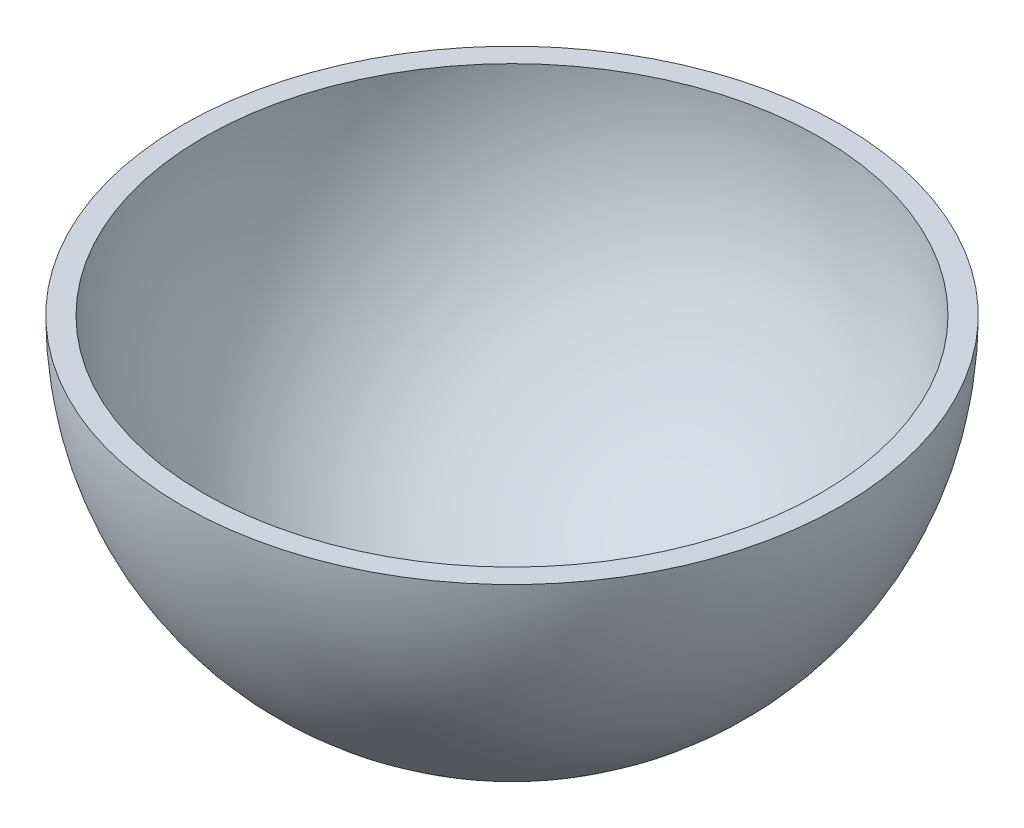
from build123d import *


with BuildPart() as part:
    # Sketch1 → Revolve1 (revolve)
    with BuildSketch(Plane.XY):
        with BuildLine():
            Line((-215.9, 0), (-201.9, 0))
            ThreePointArc((-201.9, 0), (-142.764859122, -142.764859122), (0, -201.9))
            Line((0, -201.9), (0, -215.9))
            ThreePointArc((0, -215.9), (-152.664354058, -152.664354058), (-215.9, 0))
        make_face()
    revolve(axis=Axis((0, 91.568984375, 0), (0, -1, 0)))

    # Sketch8 → Vacum Port (revolve, cut)
    with BuildSketch(Plane(origin=(0, 0, 0), x_dir=(0, 0, -1), z_dir=(1, 0, 0)), mode=Mode.PRIVATE) as vacum_port_sk:
        Polygon((84.094237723, -180.340674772), (86.430789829, -179.251122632), (93.490995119, -194.391781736), (99.787024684, -191.455894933), (101.704680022, -195.568320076), (93.072098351, -199.593759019), align=None)
    revolve(vacum_port_sk.sketch.rotate(Axis((0, 0, 0), (0, -0.9063077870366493, -0.42261826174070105)), 180), axis=Axis((0, 0, 0), (0, -0.9063077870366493, -0.42261826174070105)), mode=Mode.SUBTRACT)


solid = part.part
